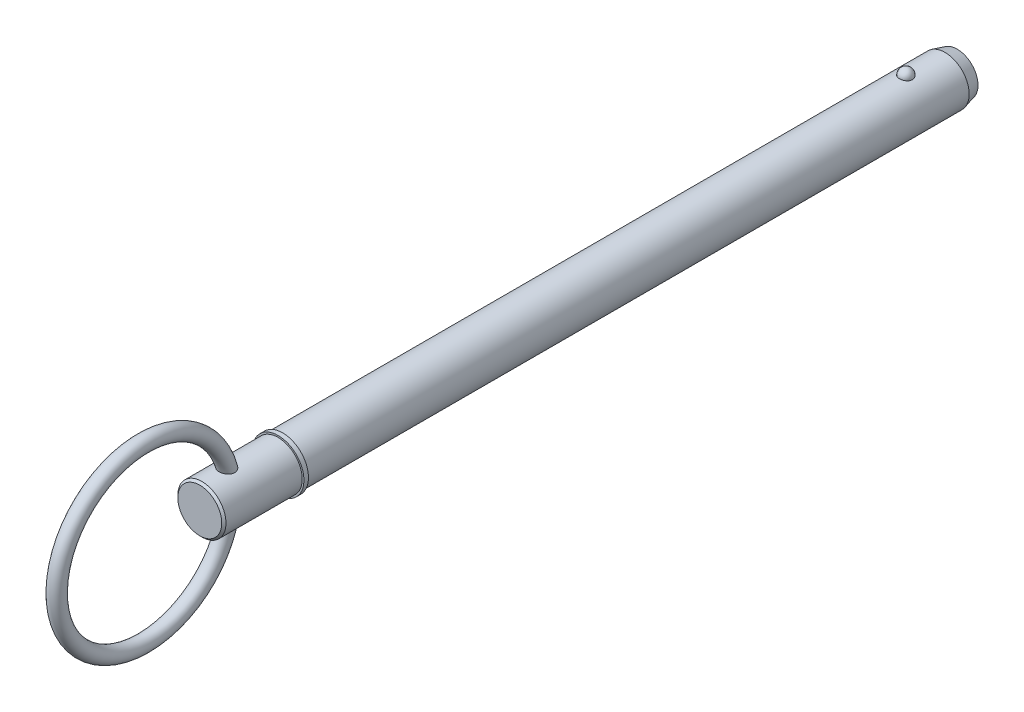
from build123d import *

# Parameters (mm, degrees)
SKETCH2_R           = 7.94
BOSS_EXTRUDE1_DEPTH = 203.2
BOSS_EXTRUDE2_START = 19.05
SKETCH3_R           = 7.94
BOSS_EXTRUDE2_DEPTH = 19.05
CHAMFER1_SIZE       = 4
CHAMFER1_SIZE2      = 1.07179677
SKETCH20_W          = 1.5
SKETCH20_H          = 8.5
SKETCH21_R          = 7.94
BOSS_EXTRUDE3_DEPTH = 27.31
CHAMFER2_SIZE       = 0.7
SKETCH24_R          = 2.5


with BuildPart() as part:
    # Sketch2 → Boss-Extrude1 (new body)
    with BuildSketch(Plane.XY):
        Circle(SKETCH2_R)
    extrude(amount=BOSS_EXTRUDE1_DEPTH)

    # Sketch3 → Boss-Extrude2 (add)
    with BuildSketch(Plane(origin=(0, 0, 0), x_dir=(-1, 0, 0), z_dir=(0, 0, -1)).offset(BOSS_EXTRUDE2_START)):
        Circle(SKETCH3_R)
    extrude(amount=-BOSS_EXTRUDE2_DEPTH)

    # Chamfer1
    chamfer1_edges = [part.edges().sort_by_distance(p)[0] for p in [
        (7.94, 0, -19.05),
    ]]
    chamfer1_side = [part.faces().sort_by_distance(p)[0] for p in [
        (7.94, 0, -9.525),
    ]]
    chamfer(chamfer1_edges, length=CHAMFER1_SIZE, length2=CHAMFER1_SIZE2, reference=chamfer1_side[0])

    # Sketch18 → Revolve1 (revolve)
    with BuildSketch(Plane(origin=(0, 0, 0), x_dir=(0, 0, -1), z_dir=(1, 0, 0))):
        with BuildLine():
            Line((2.15, 10.09), (2.15, 5.79))
            ThreePointArc((2.15, 5.79), (0, 7.94), (2.15, 10.09))
        make_face()
    revolve(axis=Axis((0, 10.09, -2.15), (0, -1, 0)))

    # Sketch20 → Revolve2 (revolve)
    with BuildSketch(Plane(origin=(0, 0, 0), x_dir=(0, 0, -1), z_dir=(1, 0, 0)), mode=Mode.PRIVATE) as revolve2_sk:
        with Locations((-203.95, 4.25)):
            Rectangle(SKETCH20_W, SKETCH20_H)
    revolve(revolve2_sk.sketch.rotate(Axis((0, 0, 33.728787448), (0, 0, 1)), 90), axis=Axis((0, 0, 33.728787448), (0, 0, 1)))

    # Sketch21 → Boss-Extrude3 (add)
    with BuildSketch(Plane(origin=(0, 0, 203.2), x_dir=(-1, 0, 0), z_dir=(0, 0, -1))):
        Circle(SKETCH21_R)
    extrude(amount=-BOSS_EXTRUDE3_DEPTH)

    # Chamfer2
    chamfer2_edges = [part.edges().sort_by_distance(p)[0] for p in [
        (7.94, 0, 230.51),
    ]]
    chamfer(chamfer2_edges, length=CHAMFER2_SIZE)

    # Sweep1: sweep along a path in Sketch23
    with BuildLine(Plane(origin=(0, 0, 0), x_dir=(0, 0, -1), z_dir=(1, 0, 0))) as sweep1_path:
        CenterArc((-249.085, 0), 28.575, 0, 360)
    # Sketch24 → Sweep1 (sweep)
    with BuildSketch(Plane(origin=(0, 0, 0), x_dir=(1, 0, 0), z_dir=(0, 1, 0))):
        with Locations((0, -220.51)):
            Circle(SKETCH24_R)
    sweep(path=sweep1_path.line)


solid = part.part
